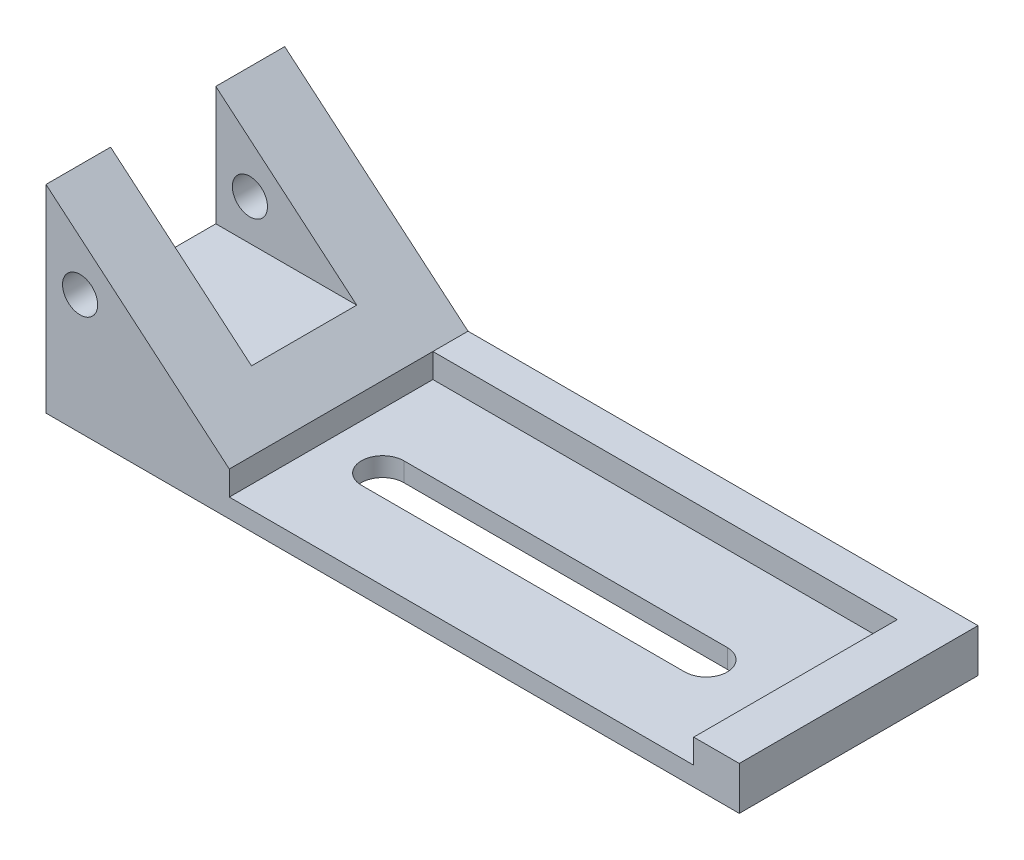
ISO-10303-21;
HEADER;
FILE_DESCRIPTION(('STEP AP214'),'2;1');
FILE_NAME('part.step','',(''),(''),'','','');
FILE_SCHEMA(('AUTOMOTIVE_DESIGN { 1 0 10303 214 1 1 1 1 }'));
ENDSEC;
DATA;
#1=APPLICATION_CONTEXT('core data for automotive mechanical design processes');
#2=APPLICATION_PROTOCOL_DEFINITION('international standard','automotive_design',2000,#1);
#3=PRODUCT_CONTEXT('',#1,'mechanical');
#4=PRODUCT('Part','Part','',(#3));
#5=PRODUCT_RELATED_PRODUCT_CATEGORY('part','',(#4));
#6=PRODUCT_DEFINITION_FORMATION('','',#4);
#7=PRODUCT_DEFINITION_CONTEXT('part definition',#1,'design');
#8=PRODUCT_DEFINITION('design','',#6,#7);
#9=PRODUCT_DEFINITION_SHAPE('','',#8);
#10=(LENGTH_UNIT() NAMED_UNIT(*) SI_UNIT(.MILLI.,.METRE.));
#11=(NAMED_UNIT(*) PLANE_ANGLE_UNIT() SI_UNIT($,.RADIAN.));
#12=(NAMED_UNIT(*) SI_UNIT($,.STERADIAN.) SOLID_ANGLE_UNIT());
#13=UNCERTAINTY_MEASURE_WITH_UNIT(LENGTH_MEASURE(1.E-05),#10,'distance_accuracy_value','');
#14=(GEOMETRIC_REPRESENTATION_CONTEXT(3) GLOBAL_UNCERTAINTY_ASSIGNED_CONTEXT((#13)) GLOBAL_UNIT_ASSIGNED_CONTEXT((#10,
#11,#12)) REPRESENTATION_CONTEXT('',''));
#15=CARTESIAN_POINT('',(0.,0.,0.));
#16=DIRECTION('',(0.,0.,1.));
#17=DIRECTION('',(1.,0.,0.));
#18=AXIS2_PLACEMENT_3D('',#15,#16,#17);
#19=CARTESIAN_POINT('',(-70.5231209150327,18.542,48.9541938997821));
#20=DIRECTION('',(0.,1.,0.));
#21=DIRECTION('',(0.,0.,1.));
#22=AXIS2_PLACEMENT_3D('',#19,#20,#21);
#23=PLANE('',#22);
#24=DIRECTION('',(-1.,0.,0.));
#25=VECTOR('',#24,1.);
#26=CARTESIAN_POINT('',(8.00572916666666,18.542,-38.265965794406));
#27=LINE('',#26,#25);
#28=CARTESIAN_POINT('',(206.95294283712,18.542,-38.265965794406));
#29=VERTEX_POINT('',#28);
#30=CARTESIAN_POINT('',(8.00572916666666,18.542,-38.265965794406));
#31=VERTEX_POINT('',#30);
#32=EDGE_CURVE('E182',#29,#31,#27,.T.);
#33=ORIENTED_EDGE('',*,*,#32,.F.);
#34=DIRECTION('',(0.,0.,-1.));
#35=VECTOR('',#34,1.);
#36=CARTESIAN_POINT('',(206.95294283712,18.542,48.9541938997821));
#37=LINE('',#36,#35);
#38=CARTESIAN_POINT('',(206.95294283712,18.542,48.9541938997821));
#39=VERTEX_POINT('',#38);
#40=EDGE_CURVE('E179',#39,#29,#37,.T.);
#41=ORIENTED_EDGE('',*,*,#40,.F.);
#42=DIRECTION('',(1.,0.,0.));
#43=VECTOR('',#42,1.);
#44=CARTESIAN_POINT('',(-70.5231209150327,18.542,48.9541938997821));
#45=LINE('',#44,#43);
#46=CARTESIAN_POINT('',(226.47339234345,18.542,48.9541938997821));
#47=VERTEX_POINT('',#46);
#48=EDGE_CURVE('E241',#39,#47,#45,.T.);
#49=ORIENTED_EDGE('',*,*,#48,.T.);
#50=DIRECTION('',(0.,0.,-1.));
#51=VECTOR('',#50,1.);
#52=CARTESIAN_POINT('',(226.47339234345,18.542,-53.3164488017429));
#53=LINE('',#52,#51);
#54=CARTESIAN_POINT('',(226.47339234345,18.542,-53.3164488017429));
#55=VERTEX_POINT('',#54);
#56=EDGE_CURVE('E244',#47,#55,#53,.T.);
#57=ORIENTED_EDGE('',*,*,#56,.T.);
#58=DIRECTION('',(-1.,0.,0.));
#59=VECTOR('',#58,1.);
#60=CARTESIAN_POINT('',(-70.5231209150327,18.542,-53.3164488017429));
#61=LINE('',#60,#59);
#62=CARTESIAN_POINT('',(8.00572916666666,18.542,-53.3164488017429));
#63=VERTEX_POINT('',#62);
#64=EDGE_CURVE('E252',#55,#63,#61,.T.);
#65=ORIENTED_EDGE('',*,*,#64,.T.);
#66=DIRECTION('',(0.,0.,1.));
#67=VECTOR('',#66,1.);
#68=CARTESIAN_POINT('',(8.00572916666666,18.542,-156.106389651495));
#69=LINE('',#68,#67);
#70=EDGE_CURVE('E227',#63,#31,#69,.T.);
#71=ORIENTED_EDGE('',*,*,#70,.T.);
#72=EDGE_LOOP('',(#33,#41,#49,#57,#65,#71));
#73=FACE_BOUND('',#72,.T.);
#74=ADVANCED_FACE('F31',(#73),#23,.T.);
#75=CARTESIAN_POINT('',(-70.5231209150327,18.542,-53.3164488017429));
#76=DIRECTION('',(1.,0.,0.));
#77=DIRECTION('',(0.,0.,-1.));
#78=AXIS2_PLACEMENT_3D('',#75,#76,#77);
#79=PLANE('',#78);
#80=DIRECTION('',(0.,0.,1.));
#81=VECTOR('',#80,1.);
#82=CARTESIAN_POINT('',(-70.5231209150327,33.8820545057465,-23.7907597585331));
#83=LINE('',#82,#81);
#84=CARTESIAN_POINT('',(-70.5231209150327,33.8820545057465,-23.7907597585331));
#85=VERTEX_POINT('',#84);
#86=CARTESIAN_POINT('',(-70.5231209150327,33.8820545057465,21.2774573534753));
#87=VERTEX_POINT('',#86);
#88=EDGE_CURVE('E207',#85,#87,#83,.T.);
#89=ORIENTED_EDGE('',*,*,#88,.F.);
#90=DIRECTION('',(0.,-1.,0.));
#91=VECTOR('',#90,1.);
#92=CARTESIAN_POINT('',(-70.5231209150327,84.8668946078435,-23.7907597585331));
#93=LINE('',#92,#91);
#94=CARTESIAN_POINT('',(-70.5231209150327,84.8668946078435,-23.7907597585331));
#95=VERTEX_POINT('',#94);
#96=EDGE_CURVE('E200',#95,#85,#93,.T.);
#97=ORIENTED_EDGE('',*,*,#96,.F.);
#98=DIRECTION('',(0.,0.,1.));
#99=VECTOR('',#98,1.);
#100=CARTESIAN_POINT('',(-70.5231209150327,84.8668946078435,-156.106389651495));
#101=LINE('',#100,#99);
#102=CARTESIAN_POINT('',(-70.5231209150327,84.8668946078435,-53.3164488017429));
#103=VERTEX_POINT('',#102);
#104=EDGE_CURVE('E217',#103,#95,#101,.T.);
#105=ORIENTED_EDGE('',*,*,#104,.F.);
#106=DIRECTION('',(0.,-1.,0.));
#107=VECTOR('',#106,1.);
#108=CARTESIAN_POINT('',(-70.5231209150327,18.542,-53.3164488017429));
#109=LINE('',#108,#107);
#110=CARTESIAN_POINT('',(-70.5231209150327,0.,-53.3164488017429));
#111=VERTEX_POINT('',#110);
#112=EDGE_CURVE('E255',#103,#111,#109,.T.);
#113=ORIENTED_EDGE('',*,*,#112,.T.);
#114=DIRECTION('',(0.,0.,1.));
#115=VECTOR('',#114,1.);
#116=CARTESIAN_POINT('',(-70.5231209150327,0.,-53.3164488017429));
#117=LINE('',#116,#115);
#118=CARTESIAN_POINT('',(-70.5231209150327,0.,48.9541938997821));
#119=VERTEX_POINT('',#118);
#120=EDGE_CURVE('E224',#111,#119,#117,.T.);
#121=ORIENTED_EDGE('',*,*,#120,.T.);
#122=DIRECTION('',(0.,-1.,0.));
#123=VECTOR('',#122,1.);
#124=CARTESIAN_POINT('',(-70.5231209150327,18.542,48.9541938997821));
#125=LINE('',#124,#123);
#126=CARTESIAN_POINT('',(-70.5231209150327,84.8668946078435,48.9541938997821));
#127=VERTEX_POINT('',#126);
#128=EDGE_CURVE('E238',#127,#119,#125,.T.);
#129=ORIENTED_EDGE('',*,*,#128,.F.);
#130=CARTESIAN_POINT('',(-70.5231209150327,84.8668946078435,21.2774573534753));
#131=VERTEX_POINT('',#130);
#132=EDGE_CURVE('E221',#131,#127,#101,.T.);
#133=ORIENTED_EDGE('',*,*,#132,.F.);
#134=DIRECTION('',(0.,1.,0.));
#135=VECTOR('',#134,1.);
#136=CARTESIAN_POINT('',(-70.5231209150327,84.8668946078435,21.2774573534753));
#137=LINE('',#136,#135);
#138=EDGE_CURVE('E210',#87,#131,#137,.T.);
#139=ORIENTED_EDGE('',*,*,#138,.F.);
#140=EDGE_LOOP('',(#89,#97,#105,#113,#121,#129,#133,#139));
#141=FACE_BOUND('',#140,.T.);
#142=ADVANCED_FACE('F33',(#141),#79,.F.);
#143=CARTESIAN_POINT('',(-70.5231209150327,18.542,48.9541938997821));
#144=DIRECTION('',(0.,0.,-1.));
#145=DIRECTION('',(-1.,0.,0.));
#146=AXIS2_PLACEMENT_3D('',#143,#144,#145);
#147=PLANE('',#146);
#148=CARTESIAN_POINT('',(-55.9159542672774,51.2780309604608,48.9541938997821));
#149=DIRECTION('',(0.,0.,1.));
#150=DIRECTION('',(1.,0.,0.));
#151=AXIS2_PLACEMENT_3D('',#148,#149,#150);
#152=CIRCLE('',#151,7.52590952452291);
#153=CARTESIAN_POINT('',(-48.3900447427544,51.2780309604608,48.9541938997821));
#154=VERTEX_POINT('',#153);
#155=EDGE_CURVE('E379',#154,#154,#152,.T.);
#156=ORIENTED_EDGE('',*,*,#155,.F.);
#157=EDGE_LOOP('',(#156));
#158=FACE_BOUND('',#157,.T.);
#159=DIRECTION('',(1.,0.,0.));
#160=VECTOR('',#159,1.);
#161=CARTESIAN_POINT('',(8.00572916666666,8.128,48.9541938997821));
#162=LINE('',#161,#160);
#163=CARTESIAN_POINT('',(8.00572916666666,8.128,48.9541938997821));
#164=VERTEX_POINT('',#163);
#165=CARTESIAN_POINT('',(206.95294283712,8.128,48.9541938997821));
#166=VERTEX_POINT('',#165);
#167=EDGE_CURVE('E187',#164,#166,#162,.T.);
#168=ORIENTED_EDGE('',*,*,#167,.F.);
#169=DIRECTION('',(0.,1.,0.));
#170=VECTOR('',#169,1.);
#171=CARTESIAN_POINT('',(8.00572916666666,8.128,48.9541938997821));
#172=LINE('',#171,#170);
#173=CARTESIAN_POINT('',(8.00572916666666,18.542,48.9541938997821));
#174=VERTEX_POINT('',#173);
#175=EDGE_CURVE('E196',#164,#174,#172,.T.);
#176=ORIENTED_EDGE('',*,*,#175,.T.);
#177=DIRECTION('',(-0.763974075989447,0.645246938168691,0.));
#178=VECTOR('',#177,1.);
#179=CARTESIAN_POINT('',(8.00572916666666,18.542,48.9541938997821));
#180=LINE('',#179,#178);
#181=EDGE_CURVE('E215',#174,#127,#180,.T.);
#182=ORIENTED_EDGE('',*,*,#181,.T.);
#183=ORIENTED_EDGE('',*,*,#128,.T.);
#184=DIRECTION('',(1.,0.,0.));
#185=VECTOR('',#184,1.);
#186=CARTESIAN_POINT('',(-70.5231209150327,0.,48.9541938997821));
#187=LINE('',#186,#185);
#188=CARTESIAN_POINT('',(226.47339234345,0.,48.9541938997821));
#189=VERTEX_POINT('',#188);
#190=EDGE_CURVE('E300',#119,#189,#187,.T.);
#191=ORIENTED_EDGE('',*,*,#190,.T.);
#192=DIRECTION('',(0.,-1.,0.));
#193=VECTOR('',#192,1.);
#194=CARTESIAN_POINT('',(226.47339234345,18.542,48.9541938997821));
#195=LINE('',#194,#193);
#196=EDGE_CURVE('E283',#47,#189,#195,.T.);
#197=ORIENTED_EDGE('',*,*,#196,.F.);
#198=ORIENTED_EDGE('',*,*,#48,.F.);
#199=DIRECTION('',(0.,1.,0.));
#200=VECTOR('',#199,1.);
#201=CARTESIAN_POINT('',(206.95294283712,8.128,48.9541938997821));
#202=LINE('',#201,#200);
#203=EDGE_CURVE('E203',#166,#39,#202,.T.);
#204=ORIENTED_EDGE('',*,*,#203,.F.);
#205=EDGE_LOOP('',(#168,#176,#182,#183,#191,#197,#198,#204));
#206=FACE_BOUND('',#205,.T.);
#207=ADVANCED_FACE('F267',(#158,#206),#147,.F.);
#208=CARTESIAN_POINT('',(226.47339234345,18.542,-53.3164488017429));
#209=DIRECTION('',(-1.,0.,0.));
#210=DIRECTION('',(0.,0.,1.));
#211=AXIS2_PLACEMENT_3D('',#208,#209,#210);
#212=PLANE('',#211);
#213=DIRECTION('',(0.,0.,-1.));
#214=VECTOR('',#213,1.);
#215=CARTESIAN_POINT('',(226.47339234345,0.,-53.3164488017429));
#216=LINE('',#215,#214);
#217=CARTESIAN_POINT('',(226.47339234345,0.,-53.3164488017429));
#218=VERTEX_POINT('',#217);
#219=EDGE_CURVE('E301',#189,#218,#216,.T.);
#220=ORIENTED_EDGE('',*,*,#219,.T.);
#221=DIRECTION('',(0.,-1.,0.));
#222=VECTOR('',#221,1.);
#223=CARTESIAN_POINT('',(226.47339234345,18.542,-53.3164488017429));
#224=LINE('',#223,#222);
#225=EDGE_CURVE('E285',#55,#218,#224,.T.);
#226=ORIENTED_EDGE('',*,*,#225,.F.);
#227=ORIENTED_EDGE('',*,*,#56,.F.);
#228=ORIENTED_EDGE('',*,*,#196,.T.);
#229=EDGE_LOOP('',(#220,#226,#227,#228));
#230=FACE_BOUND('',#229,.T.);
#231=ADVANCED_FACE('F304',(#230),#212,.F.);
#232=CARTESIAN_POINT('',(-70.5231209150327,18.542,-53.3164488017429));
#233=DIRECTION('',(0.,0.,1.));
#234=DIRECTION('',(1.,0.,0.));
#235=AXIS2_PLACEMENT_3D('',#232,#233,#234);
#236=PLANE('',#235);
#237=CARTESIAN_POINT('',(-55.9159542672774,51.2780309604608,-53.3164488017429));
#238=DIRECTION('',(0.,0.,1.));
#239=DIRECTION('',(1.,0.,0.));
#240=AXIS2_PLACEMENT_3D('',#237,#238,#239);
#241=CIRCLE('',#240,7.52590952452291);
#242=CARTESIAN_POINT('',(-48.3900447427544,51.2780309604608,-53.3164488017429));
#243=VERTEX_POINT('',#242);
#244=EDGE_CURVE('E375',#243,#243,#241,.T.);
#245=ORIENTED_EDGE('',*,*,#244,.T.);
#246=EDGE_LOOP('',(#245));
#247=FACE_BOUND('',#246,.T.);
#248=DIRECTION('',(-1.,0.,0.));
#249=VECTOR('',#248,1.);
#250=CARTESIAN_POINT('',(-70.5231209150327,0.,-53.3164488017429));
#251=LINE('',#250,#249);
#252=EDGE_CURVE('E245',#218,#111,#251,.T.);
#253=ORIENTED_EDGE('',*,*,#252,.T.);
#254=ORIENTED_EDGE('',*,*,#112,.F.);
#255=DIRECTION('',(0.763974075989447,-0.645246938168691,0.));
#256=VECTOR('',#255,1.);
#257=CARTESIAN_POINT('',(8.00572916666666,18.542,-53.3164488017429));
#258=LINE('',#257,#256);
#259=EDGE_CURVE('E220',#103,#63,#258,.T.);
#260=ORIENTED_EDGE('',*,*,#259,.T.);
#261=ORIENTED_EDGE('',*,*,#64,.F.);
#262=ORIENTED_EDGE('',*,*,#225,.T.);
#263=EDGE_LOOP('',(#253,#254,#260,#261,#262));
#264=FACE_BOUND('',#263,.T.);
#265=ADVANCED_FACE('F302',(#247,#264),#236,.F.);
#266=CARTESIAN_POINT('',(-70.5231209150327,0.,48.9541938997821));
#267=DIRECTION('',(0.,1.,0.));
#268=DIRECTION('',(0.,0.,1.));
#269=AXIS2_PLACEMENT_3D('',#266,#267,#268);
#270=PLANE('',#269);
#271=DIRECTION('',(1.,0.,0.));
#272=VECTOR('',#271,1.);
#273=CARTESIAN_POINT('',(170.465352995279,0.,16.2680207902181));
#274=LINE('',#273,#272);
#275=CARTESIAN_POINT('',(31.9043359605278,0.,16.2680207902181));
#276=VERTEX_POINT('',#275);
#277=CARTESIAN_POINT('',(170.465352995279,0.,16.2680207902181));
#278=VERTEX_POINT('',#277);
#279=EDGE_CURVE('E171',#276,#278,#274,.T.);
#280=ORIENTED_EDGE('',*,*,#279,.T.);
#281=CARTESIAN_POINT('',(170.465352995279,0.,7.17998742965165));
#282=DIRECTION('',(0.,1.,0.));
#283=DIRECTION('',(0.,0.,1.));
#284=AXIS2_PLACEMENT_3D('',#281,#282,#283);
#285=CIRCLE('',#284,9.08803336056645);
#286=CARTESIAN_POINT('',(170.465352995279,0.,-1.90804593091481));
#287=VERTEX_POINT('',#286);
#288=EDGE_CURVE('E162',#278,#287,#285,.T.);
#289=ORIENTED_EDGE('',*,*,#288,.T.);
#290=DIRECTION('',(-1.,0.,0.));
#291=VECTOR('',#290,1.);
#292=CARTESIAN_POINT('',(170.465352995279,0.,-1.90804593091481));
#293=LINE('',#292,#291);
#294=CARTESIAN_POINT('',(31.9043359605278,0.,-1.90804593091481));
#295=VERTEX_POINT('',#294);
#296=EDGE_CURVE('E168',#287,#295,#293,.T.);
#297=ORIENTED_EDGE('',*,*,#296,.T.);
#298=CARTESIAN_POINT('',(31.9043359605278,0.,7.17998742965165));
#299=DIRECTION('',(0.,1.,0.));
#300=DIRECTION('',(0.,0.,1.));
#301=AXIS2_PLACEMENT_3D('',#298,#299,#300);
#302=CIRCLE('',#301,9.08803336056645);
#303=EDGE_CURVE('E48',#295,#276,#302,.T.);
#304=ORIENTED_EDGE('',*,*,#303,.T.);
#305=EDGE_LOOP('',(#280,#289,#297,#304));
#306=FACE_BOUND('',#305,.T.);
#307=ORIENTED_EDGE('',*,*,#120,.F.);
#308=ORIENTED_EDGE('',*,*,#252,.F.);
#309=ORIENTED_EDGE('',*,*,#219,.F.);
#310=ORIENTED_EDGE('',*,*,#190,.F.);
#311=EDGE_LOOP('',(#307,#308,#309,#310));
#312=FACE_BOUND('',#311,.T.);
#313=ADVANCED_FACE('F299',(#306,#312),#270,.F.);
#314=CARTESIAN_POINT('',(8.00572916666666,18.542,-156.106389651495));
#315=DIRECTION('',(0.645246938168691,0.763974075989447,0.));
#316=DIRECTION('',(-0.763974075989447,0.645246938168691,0.));
#317=AXIS2_PLACEMENT_3D('',#314,#315,#316);
#318=PLANE('',#317);
#319=DIRECTION('',(-0.763974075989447,0.645246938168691,0.));
#320=VECTOR('',#319,1.);
#321=CARTESIAN_POINT('',(8.00572916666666,18.542,-23.7907597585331));
#322=LINE('',#321,#320);
#323=CARTESIAN_POINT('',(-10.1569358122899,33.8820545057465,-23.7907597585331));
#324=VERTEX_POINT('',#323);
#325=EDGE_CURVE('E11',#324,#95,#322,.T.);
#326=ORIENTED_EDGE('',*,*,#325,.F.);
#327=DIRECTION('',(0.,0.,-1.));
#328=VECTOR('',#327,1.);
#329=CARTESIAN_POINT('',(-10.1569358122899,33.8820545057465,-156.106389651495));
#330=LINE('',#329,#328);
#331=CARTESIAN_POINT('',(-10.1569358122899,33.8820545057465,21.2774573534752));
#332=VERTEX_POINT('',#331);
#333=EDGE_CURVE('E236',#332,#324,#330,.T.);
#334=ORIENTED_EDGE('',*,*,#333,.F.);
#335=DIRECTION('',(0.763974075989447,-0.645246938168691,0.));
#336=VECTOR('',#335,1.);
#337=CARTESIAN_POINT('',(8.00572916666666,18.542,21.2774573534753));
#338=LINE('',#337,#336);
#339=EDGE_CURVE('E40',#131,#332,#338,.T.);
#340=ORIENTED_EDGE('',*,*,#339,.F.);
#341=ORIENTED_EDGE('',*,*,#132,.T.);
#342=ORIENTED_EDGE('',*,*,#181,.F.);
#343=DIRECTION('',(0.,0.,1.));
#344=VECTOR('',#343,1.);
#345=CARTESIAN_POINT('',(8.00572916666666,18.542,48.9541938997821));
#346=LINE('',#345,#344);
#347=EDGE_CURVE('E176',#31,#174,#346,.T.);
#348=ORIENTED_EDGE('',*,*,#347,.F.);
#349=ORIENTED_EDGE('',*,*,#70,.F.);
#350=ORIENTED_EDGE('',*,*,#259,.F.);
#351=ORIENTED_EDGE('',*,*,#104,.T.);
#352=EDGE_LOOP('',(#326,#334,#340,#341,#342,#348,#349,#350,#351));
#353=FACE_BOUND('',#352,.T.);
#354=ADVANCED_FACE('F273',(#353),#318,.T.);
#355=CARTESIAN_POINT('',(226.47341734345,84.8668946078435,-23.7907597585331));
#356=DIRECTION('',(0.,0.,-1.));
#357=DIRECTION('',(-1.,0.,0.));
#358=AXIS2_PLACEMENT_3D('',#355,#356,#357);
#359=PLANE('',#358);
#360=CARTESIAN_POINT('',(-55.9159542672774,51.2780309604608,-23.7907597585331));
#361=DIRECTION('',(0.,0.,-1.));
#362=DIRECTION('',(-1.,0.,0.));
#363=AXIS2_PLACEMENT_3D('',#360,#361,#362);
#364=CIRCLE('',#363,7.52590952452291);
#365=CARTESIAN_POINT('',(-63.4418637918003,51.2780309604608,-23.7907597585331));
#366=VERTEX_POINT('',#365);
#367=EDGE_CURVE('E373',#366,#366,#364,.T.);
#368=ORIENTED_EDGE('',*,*,#367,.T.);
#369=EDGE_LOOP('',(#368));
#370=FACE_BOUND('',#369,.T.);
#371=ORIENTED_EDGE('',*,*,#325,.T.);
#372=ORIENTED_EDGE('',*,*,#96,.T.);
#373=DIRECTION('',(-1.,0.,0.));
#374=VECTOR('',#373,1.);
#375=CARTESIAN_POINT('',(226.47341734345,33.8820545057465,-23.7907597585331));
#376=LINE('',#375,#374);
#377=EDGE_CURVE('E212',#324,#85,#376,.T.);
#378=ORIENTED_EDGE('',*,*,#377,.F.);
#379=EDGE_LOOP('',(#371,#372,#378));
#380=FACE_BOUND('',#379,.T.);
#381=ADVANCED_FACE('F325',(#370,#380),#359,.F.);
#382=CARTESIAN_POINT('',(226.47341734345,84.8668946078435,21.2774573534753));
#383=DIRECTION('',(0.,0.,1.));
#384=DIRECTION('',(1.,0.,0.));
#385=AXIS2_PLACEMENT_3D('',#382,#383,#384);
#386=PLANE('',#385);
#387=CARTESIAN_POINT('',(-55.9159542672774,51.2780309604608,21.2774573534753));
#388=DIRECTION('',(0.,0.,1.));
#389=DIRECTION('',(1.,0.,0.));
#390=AXIS2_PLACEMENT_3D('',#387,#388,#389);
#391=CIRCLE('',#390,7.52590952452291);
#392=CARTESIAN_POINT('',(-48.3900447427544,51.2780309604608,21.2774573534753));
#393=VERTEX_POINT('',#392);
#394=EDGE_CURVE('E35',#393,#393,#391,.T.);
#395=ORIENTED_EDGE('',*,*,#394,.T.);
#396=EDGE_LOOP('',(#395));
#397=FACE_BOUND('',#396,.T.);
#398=ORIENTED_EDGE('',*,*,#339,.T.);
#399=DIRECTION('',(-1.,0.,0.));
#400=VECTOR('',#399,1.);
#401=CARTESIAN_POINT('',(226.47341734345,33.8820545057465,21.2774573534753));
#402=LINE('',#401,#400);
#403=EDGE_CURVE('E213',#332,#87,#402,.T.);
#404=ORIENTED_EDGE('',*,*,#403,.T.);
#405=ORIENTED_EDGE('',*,*,#138,.T.);
#406=EDGE_LOOP('',(#398,#404,#405));
#407=FACE_BOUND('',#406,.T.);
#408=ADVANCED_FACE('F328',(#397,#407),#386,.F.);
#409=CARTESIAN_POINT('',(226.47341734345,33.8820545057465,-23.7907597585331));
#410=DIRECTION('',(0.,-1.,0.));
#411=DIRECTION('',(0.,0.,-1.));
#412=AXIS2_PLACEMENT_3D('',#409,#410,#411);
#413=PLANE('',#412);
#414=ORIENTED_EDGE('',*,*,#333,.T.);
#415=ORIENTED_EDGE('',*,*,#377,.T.);
#416=ORIENTED_EDGE('',*,*,#88,.T.);
#417=ORIENTED_EDGE('',*,*,#403,.F.);
#418=EDGE_LOOP('',(#414,#415,#416,#417));
#419=FACE_BOUND('',#418,.T.);
#420=ADVANCED_FACE('F330',(#419),#413,.F.);
#421=CARTESIAN_POINT('',(8.00572916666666,8.128,48.9541938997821));
#422=DIRECTION('',(-1.,0.,0.));
#423=DIRECTION('',(0.,0.,1.));
#424=AXIS2_PLACEMENT_3D('',#421,#422,#423);
#425=PLANE('',#424);
#426=ORIENTED_EDGE('',*,*,#347,.T.);
#427=ORIENTED_EDGE('',*,*,#175,.F.);
#428=DIRECTION('',(0.,0.,1.));
#429=VECTOR('',#428,1.);
#430=CARTESIAN_POINT('',(8.00572916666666,8.128,48.9541938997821));
#431=LINE('',#430,#429);
#432=CARTESIAN_POINT('',(8.00572916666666,8.128,-38.265965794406));
#433=VERTEX_POINT('',#432);
#434=EDGE_CURVE('E184',#433,#164,#431,.T.);
#435=ORIENTED_EDGE('',*,*,#434,.F.);
#436=DIRECTION('',(0.,1.,0.));
#437=VECTOR('',#436,1.);
#438=CARTESIAN_POINT('',(8.00572916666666,8.128,-38.265965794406));
#439=LINE('',#438,#437);
#440=EDGE_CURVE('E197',#433,#31,#439,.T.);
#441=ORIENTED_EDGE('',*,*,#440,.T.);
#442=EDGE_LOOP('',(#426,#427,#435,#441));
#443=FACE_BOUND('',#442,.T.);
#444=ADVANCED_FACE('F333',(#443),#425,.F.);
#445=CARTESIAN_POINT('',(8.00572916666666,8.128,-38.265965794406));
#446=DIRECTION('',(0.,0.,-1.));
#447=DIRECTION('',(-1.,0.,0.));
#448=AXIS2_PLACEMENT_3D('',#445,#446,#447);
#449=PLANE('',#448);
#450=ORIENTED_EDGE('',*,*,#32,.T.);
#451=ORIENTED_EDGE('',*,*,#440,.F.);
#452=DIRECTION('',(-1.,0.,0.));
#453=VECTOR('',#452,1.);
#454=CARTESIAN_POINT('',(8.00572916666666,8.128,-38.265965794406));
#455=LINE('',#454,#453);
#456=CARTESIAN_POINT('',(206.95294283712,8.128,-38.265965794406));
#457=VERTEX_POINT('',#456);
#458=EDGE_CURVE('E193',#457,#433,#455,.T.);
#459=ORIENTED_EDGE('',*,*,#458,.F.);
#460=DIRECTION('',(0.,1.,0.));
#461=VECTOR('',#460,1.);
#462=CARTESIAN_POINT('',(206.95294283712,8.128,-38.265965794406));
#463=LINE('',#462,#461);
#464=EDGE_CURVE('E201',#457,#29,#463,.T.);
#465=ORIENTED_EDGE('',*,*,#464,.T.);
#466=EDGE_LOOP('',(#450,#451,#459,#465));
#467=FACE_BOUND('',#466,.T.);
#468=ADVANCED_FACE('F340',(#467),#449,.F.);
#469=CARTESIAN_POINT('',(206.95294283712,8.128,48.9541938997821));
#470=DIRECTION('',(1.,0.,0.));
#471=DIRECTION('',(0.,0.,-1.));
#472=AXIS2_PLACEMENT_3D('',#469,#470,#471);
#473=PLANE('',#472);
#474=ORIENTED_EDGE('',*,*,#40,.T.);
#475=ORIENTED_EDGE('',*,*,#464,.F.);
#476=DIRECTION('',(0.,0.,-1.));
#477=VECTOR('',#476,1.);
#478=CARTESIAN_POINT('',(206.95294283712,8.128,48.9541938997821));
#479=LINE('',#478,#477);
#480=EDGE_CURVE('E190',#166,#457,#479,.T.);
#481=ORIENTED_EDGE('',*,*,#480,.F.);
#482=ORIENTED_EDGE('',*,*,#203,.T.);
#483=EDGE_LOOP('',(#474,#475,#481,#482));
#484=FACE_BOUND('',#483,.T.);
#485=ADVANCED_FACE('F342',(#484),#473,.F.);
#486=CARTESIAN_POINT('',(8.00572916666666,8.128,-38.265965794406));
#487=DIRECTION('',(0.,-1.,0.));
#488=DIRECTION('',(0.,0.,-1.));
#489=AXIS2_PLACEMENT_3D('',#486,#487,#488);
#490=PLANE('',#489);
#491=DIRECTION('',(-1.,0.,0.));
#492=VECTOR('',#491,1.);
#493=CARTESIAN_POINT('',(170.465352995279,8.128,-1.90804593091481));
#494=LINE('',#493,#492);
#495=CARTESIAN_POINT('',(170.465352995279,8.128,-1.90804593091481));
#496=VERTEX_POINT('',#495);
#497=CARTESIAN_POINT('',(31.9043359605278,8.128,-1.90804593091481));
#498=VERTEX_POINT('',#497);
#499=EDGE_CURVE('E153',#496,#498,#494,.T.);
#500=ORIENTED_EDGE('',*,*,#499,.F.);
#501=CARTESIAN_POINT('',(170.465352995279,8.128,7.17998742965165));
#502=DIRECTION('',(0.,1.,0.));
#503=DIRECTION('',(0.,0.,1.));
#504=AXIS2_PLACEMENT_3D('',#501,#502,#503);
#505=CIRCLE('',#504,9.08803336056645);
#506=CARTESIAN_POINT('',(170.465352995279,8.128,16.2680207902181));
#507=VERTEX_POINT('',#506);
#508=EDGE_CURVE('E56',#507,#496,#505,.T.);
#509=ORIENTED_EDGE('',*,*,#508,.F.);
#510=DIRECTION('',(1.,0.,0.));
#511=VECTOR('',#510,1.);
#512=CARTESIAN_POINT('',(170.465352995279,8.128,16.2680207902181));
#513=LINE('',#512,#511);
#514=CARTESIAN_POINT('',(31.9043359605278,8.128,16.2680207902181));
#515=VERTEX_POINT('',#514);
#516=EDGE_CURVE('E160',#515,#507,#513,.T.);
#517=ORIENTED_EDGE('',*,*,#516,.F.);
#518=CARTESIAN_POINT('',(31.9043359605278,8.128,7.17998742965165));
#519=DIRECTION('',(0.,1.,0.));
#520=DIRECTION('',(0.,0.,1.));
#521=AXIS2_PLACEMENT_3D('',#518,#519,#520);
#522=CIRCLE('',#521,9.08803336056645);
#523=EDGE_CURVE('E144',#498,#515,#522,.T.);
#524=ORIENTED_EDGE('',*,*,#523,.F.);
#525=EDGE_LOOP('',(#500,#509,#517,#524));
#526=FACE_BOUND('',#525,.T.);
#527=ORIENTED_EDGE('',*,*,#434,.T.);
#528=ORIENTED_EDGE('',*,*,#167,.T.);
#529=ORIENTED_EDGE('',*,*,#480,.T.);
#530=ORIENTED_EDGE('',*,*,#458,.T.);
#531=EDGE_LOOP('',(#527,#528,#529,#530));
#532=FACE_BOUND('',#531,.T.);
#533=ADVANCED_FACE('F157',(#526,#532),#490,.F.);
#534=CARTESIAN_POINT('',(170.465352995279,0.,7.17998742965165));
#535=DIRECTION('',(0.,1.,0.));
#536=DIRECTION('',(0.,0.,1.));
#537=AXIS2_PLACEMENT_3D('',#534,#535,#536);
#538=CYLINDRICAL_SURFACE('',#537,9.08803336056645);
#539=ORIENTED_EDGE('',*,*,#508,.T.);
#540=DIRECTION('',(0.,1.,0.));
#541=VECTOR('',#540,1.);
#542=CARTESIAN_POINT('',(170.465352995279,0.,-1.90804593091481));
#543=LINE('',#542,#541);
#544=EDGE_CURVE('E150',#287,#496,#543,.T.);
#545=ORIENTED_EDGE('',*,*,#544,.F.);
#546=ORIENTED_EDGE('',*,*,#288,.F.);
#547=DIRECTION('',(0.,1.,0.));
#548=VECTOR('',#547,1.);
#549=CARTESIAN_POINT('',(170.465352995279,0.,16.2680207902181));
#550=LINE('',#549,#548);
#551=EDGE_CURVE('E174',#278,#507,#550,.T.);
#552=ORIENTED_EDGE('',*,*,#551,.T.);
#553=EDGE_LOOP('',(#539,#545,#546,#552));
#554=FACE_BOUND('',#553,.T.);
#555=ADVANCED_FACE('F351',(#554),#538,.F.);
#556=CARTESIAN_POINT('',(170.465352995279,0.,16.2680207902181));
#557=DIRECTION('',(0.,0.,1.));
#558=DIRECTION('',(1.,0.,0.));
#559=AXIS2_PLACEMENT_3D('',#556,#557,#558);
#560=PLANE('',#559);
#561=ORIENTED_EDGE('',*,*,#516,.T.);
#562=ORIENTED_EDGE('',*,*,#551,.F.);
#563=ORIENTED_EDGE('',*,*,#279,.F.);
#564=DIRECTION('',(0.,1.,0.));
#565=VECTOR('',#564,1.);
#566=CARTESIAN_POINT('',(31.9043359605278,0.,16.2680207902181));
#567=LINE('',#566,#565);
#568=EDGE_CURVE('E149',#276,#515,#567,.T.);
#569=ORIENTED_EDGE('',*,*,#568,.T.);
#570=EDGE_LOOP('',(#561,#562,#563,#569));
#571=FACE_BOUND('',#570,.T.);
#572=ADVANCED_FACE('F354',(#571),#560,.F.);
#573=CARTESIAN_POINT('',(31.9043359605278,0.,7.17998742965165));
#574=DIRECTION('',(0.,1.,0.));
#575=DIRECTION('',(0.,0.,1.));
#576=AXIS2_PLACEMENT_3D('',#573,#574,#575);
#577=CYLINDRICAL_SURFACE('',#576,9.08803336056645);
#578=ORIENTED_EDGE('',*,*,#523,.T.);
#579=ORIENTED_EDGE('',*,*,#568,.F.);
#580=ORIENTED_EDGE('',*,*,#303,.F.);
#581=DIRECTION('',(0.,1.,0.));
#582=VECTOR('',#581,1.);
#583=CARTESIAN_POINT('',(31.9043359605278,0.,-1.90804593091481));
#584=LINE('',#583,#582);
#585=EDGE_CURVE('E140',#295,#498,#584,.T.);
#586=ORIENTED_EDGE('',*,*,#585,.T.);
#587=EDGE_LOOP('',(#578,#579,#580,#586));
#588=FACE_BOUND('',#587,.T.);
#589=ADVANCED_FACE('F142',(#588),#577,.F.);
#590=CARTESIAN_POINT('',(170.465352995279,0.,-1.90804593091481));
#591=DIRECTION('',(0.,0.,-1.));
#592=DIRECTION('',(-1.,0.,0.));
#593=AXIS2_PLACEMENT_3D('',#590,#591,#592);
#594=PLANE('',#593);
#595=ORIENTED_EDGE('',*,*,#499,.T.);
#596=ORIENTED_EDGE('',*,*,#585,.F.);
#597=ORIENTED_EDGE('',*,*,#296,.F.);
#598=ORIENTED_EDGE('',*,*,#544,.T.);
#599=EDGE_LOOP('',(#595,#596,#597,#598));
#600=FACE_BOUND('',#599,.T.);
#601=ADVANCED_FACE('F154',(#600),#594,.F.);
#602=CARTESIAN_POINT('',(-55.9159542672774,51.2780309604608,-53.3164988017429));
#603=DIRECTION('',(0.,0.,1.));
#604=DIRECTION('',(1.,0.,0.));
#605=AXIS2_PLACEMENT_3D('',#602,#603,#604);
#606=CYLINDRICAL_SURFACE('',#605,7.52590952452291);
#607=ORIENTED_EDGE('',*,*,#155,.T.);
#608=EDGE_LOOP('',(#607));
#609=FACE_BOUND('',#608,.T.);
#610=ORIENTED_EDGE('',*,*,#394,.F.);
#611=EDGE_LOOP('',(#610));
#612=FACE_BOUND('',#611,.T.);
#613=ADVANCED_FACE('F357',(#609,#612),#606,.F.);
#614=ORIENTED_EDGE('',*,*,#367,.F.);
#615=EDGE_LOOP('',(#614));
#616=FACE_BOUND('',#615,.T.);
#617=ORIENTED_EDGE('',*,*,#244,.F.);
#618=EDGE_LOOP('',(#617));
#619=FACE_BOUND('',#618,.T.);
#620=ADVANCED_FACE('F363',(#616,#619),#606,.F.);
#621=CLOSED_SHELL('',(#74,#142,#207,#231,#265,#313,#354,#381,#408,#420,#444,#468,#485,#533,#555,
#572,#589,#601,#613,#620));
#622=MANIFOLD_SOLID_BREP('B2',#621);
#623=ADVANCED_BREP_SHAPE_REPRESENTATION('',(#18,#622),#14);
#624=SHAPE_DEFINITION_REPRESENTATION(#9,#623);
ENDSEC;
END-ISO-10303-21;
